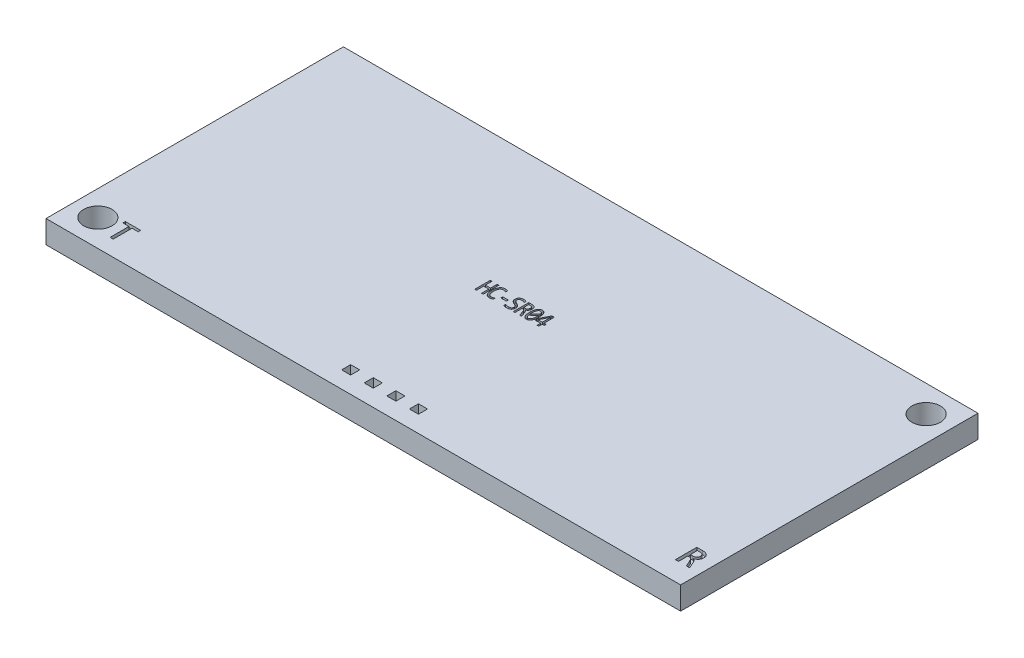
from build123d import *

# Parameters (mm, degrees)
CROQUIS1_W              = 44.6
CROQUIS1_H              = 20.9
CROQUIS1_R              = 1
SALIENTE_EXTRUIR2_DEPTH = 1.6
CROQUIS3_W              = 0.396538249
CROQUIS3_H              = 0.136456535
CORTAR_EXTRUIR1_DEPTH   = 1
CORTAR_EXTRUIR2_DEPTH   = 1
CROQUIS5_W              = 0.636
CROQUIS5_H              = 0.636
CORTAR_EXTRUIR4_DEPTH   = 10


with BuildPart() as part:
    # Croquis1 → Saliente-Extruir2 (new body)
    with BuildSketch(Plane(origin=(0, 0, 0), x_dir=(1, 0, 0), z_dir=(0, 1, 0))):
        with Locations((22.3, -10.45)):
            Rectangle(CROQUIS1_W, CROQUIS1_H)
        with Locations(Location((42.832264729, -1.877461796, 0), (0, 0, 90))):
            Circle(CROQUIS1_R, mode=Mode.SUBTRACT)
        with Locations(Location((1.767735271, -19.022538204, 0), (0, 0, 90))):
            Circle(CROQUIS1_R, mode=Mode.SUBTRACT)
    extrude(amount=SALIENTE_EXTRUIR2_DEPTH)

    # Croquis3 → Cortar-Extruir1 (cut)
    # profile 1 of 7: a face of its own
    with BuildSketch(Plane(origin=(0, 2.345630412, 0), x_dir=(1, 0, 0), z_dir=(0, 1, 0))):
        Polygon((19.973748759, -10.139175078), (19.85555223, -10.139175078), (19.85555223, -9.639492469), (19.491585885, -9.639492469), (19.491585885, -10.139175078), (19.373389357, -10.139175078), (19.373389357, -9.050730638), (19.491585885, -9.050730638), (19.491585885, -9.51117891), (19.85555223, -9.51117891), (19.85555223, -9.050730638), (19.973748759, -9.050730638), align=None)
    # profile 2 of 7: a face of its own
    with BuildSketch(Plane(origin=(0, 2.345630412, 0), x_dir=(1, 0, 0), z_dir=(0, 1, 0))):
        with BuildLine():
            add(Edge.make_bspline(
                [(20.627703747, -10.098460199), (20.610374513, -10.106830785), (20.576036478, -10.123417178), (20.521537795, -10.13980278), (20.466007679, -10.15052594), (20.428456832, -10.151839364), (20.409570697, -10.152499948)],
                knots=[0, 0, 0, 0, 1.016780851, 2.014760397, 3.001527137, 4, 4, 4, 4], degree=3))
            add(Edge.make_bspline(
                [(20.409570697, -10.152499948), (20.39465692, -10.15208389), (20.365590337, -10.151273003), (20.323405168, -10.144666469), (20.283735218, -10.13430462), (20.247044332, -10.118639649), (20.212594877, -10.099464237), (20.181120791, -10.075470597), (20.152214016, -10.047356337), (20.126323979, -10.014735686), (20.103006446, -9.978093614), (20.083106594, -9.937139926), (20.066300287, -9.892082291), (20.052668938, -9.842929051), (20.041790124, -9.789759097), (20.034348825, -9.73244375), (20.029538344, -9.671077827), (20.029067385, -9.628727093), (20.028824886, -9.606920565)],
                knots=[0, 0, 0, 0, 0.94991527, 1.851361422, 2.714727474, 3.555816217, 4.386716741, 5.22119729, 6.070041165, 6.950049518, 7.869063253, 8.832533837, 9.846022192, 10.929629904, 12.079947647, 13.301629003, 14.610600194, 16, 16, 16, 16], degree=3))
            add(Edge.make_bspline(
                [(20.028824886, -9.606920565), (20.02913283, -9.585605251), (20.029734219, -9.543978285), (20.035105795, -9.483180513), (20.043285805, -9.425527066), (20.055130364, -9.371190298), (20.070082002, -9.320362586), (20.088050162, -9.273275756), (20.108975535, -9.230214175), (20.132776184, -9.19121476), (20.159158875, -9.156100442), (20.188594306, -9.125492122), (20.220573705, -9.098916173), (20.25512076, -9.076612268), (20.292290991, -9.059037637), (20.331652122, -9.046310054), (20.373254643, -9.038766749), (20.401725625, -9.037865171), (20.416233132, -9.037405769)],
                knots=[0, 0, 0, 0, 1.327786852, 2.593052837, 3.799758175, 4.953719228, 6.054723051, 7.097814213, 8.090224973, 9.033298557, 9.940388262, 10.821139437, 11.672830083, 12.525753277, 13.376225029, 14.227067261, 15.096594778, 16, 16, 16, 16], degree=3))
            add(Edge.make_bspline(
                [(20.416233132, -9.037405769), (20.42610961, -9.037519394), (20.445565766, -9.037743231), (20.47414272, -9.04035822), (20.501702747, -9.044166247), (20.528193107, -9.049998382), (20.554088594, -9.057023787), (20.579125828, -9.066310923), (20.603893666, -9.076847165), (20.619705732, -9.08539472), (20.627703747, -9.08971822)],
                knots=[0, 0, 0, 0, 1.075434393, 2.11855081, 3.123295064, 4.103821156, 5.071119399, 6.04321857, 7.010226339, 8, 8, 8, 8], degree=3))
            Line((20.627703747, -9.08971822), (20.627703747, -9.235551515))
            add(Edge.make_bspline(
                [(20.627703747, -9.235551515), (20.619883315, -9.230327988), (20.604405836, -9.219990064), (20.580041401, -9.206768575), (20.555508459, -9.195053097), (20.53031524, -9.185621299), (20.504425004, -9.178129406), (20.477451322, -9.172694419), (20.449215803, -9.169416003), (20.429978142, -9.169092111), (20.420181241, -9.168927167)],
                knots=[0, 0, 0, 0, 1.018287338, 2.015300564, 2.999852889, 3.961395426, 4.92586479, 5.916687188, 6.939059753, 8, 8, 8, 8], degree=3))
            add(Edge.make_bspline(
                [(20.420181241, -9.168927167), (20.410201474, -9.169219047), (20.390661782, -9.169790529), (20.362032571, -9.175502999), (20.334895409, -9.184577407), (20.309213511, -9.197255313), (20.285522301, -9.213519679), (20.263242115, -9.2325703), (20.243291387, -9.255352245), (20.224949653, -9.28110542), (20.208755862, -9.310014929), (20.194625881, -9.342034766), (20.182435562, -9.376959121), (20.172036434, -9.414861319), (20.163922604, -9.455589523), (20.158395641, -9.499211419), (20.154893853, -9.545503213), (20.154420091, -9.577303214), (20.154177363, -9.593595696)],
                knots=[0, 0, 0, 0, 0.855273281, 1.674565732, 2.493523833, 3.304569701, 4.122676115, 4.953136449, 5.812823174, 6.713525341, 7.661447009, 8.65019893, 9.712535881, 10.832132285, 12.019525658, 13.272043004, 14.602352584, 16, 16, 16, 16], degree=3))
            add(Edge.make_bspline(
                [(20.154177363, -9.593595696), (20.154338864, -9.610709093), (20.15465208, -9.64389894), (20.15785116, -9.692006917), (20.163284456, -9.736805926), (20.17054721, -9.778381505), (20.180092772, -9.816769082), (20.191973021, -9.851888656), (20.205603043, -9.883931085), (20.221802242, -9.912456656), (20.239713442, -9.937951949), (20.2601867, -9.959684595), (20.282222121, -9.978615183), (20.306664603, -9.993580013), (20.332842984, -10.005720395), (20.361124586, -10.013971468), (20.391376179, -10.019025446), (20.412182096, -10.019663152), (20.422895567, -10.019991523)],
                knots=[0, 0, 0, 0, 1.444903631, 2.802256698, 4.068620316, 5.253899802, 6.363986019, 7.405050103, 8.381782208, 9.299254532, 10.170420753, 11.00583044, 11.814182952, 12.6159143, 13.417765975, 14.244002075, 15.095794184, 16, 16, 16, 16], degree=3))
            add(Edge.make_bspline(
                [(20.422895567, -10.019991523), (20.432031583, -10.01979181), (20.450269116, -10.019393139), (20.477288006, -10.016501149), (20.50369148, -10.011086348), (20.538276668, -10.002004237), (20.580458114, -9.985501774), (20.611868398, -9.967582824), (20.627703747, -9.958549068)],
                knots=[0, 0, 0, 0, 0.759244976, 1.51562283, 2.254279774, 2.997099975, 4.486101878, 6, 6, 6, 6], degree=3))
            Line((20.627703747, -9.958549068), (20.627703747, -10.098460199))
        make_face()
    # profile 3 of 7: a face of its own
    with BuildSketch(Plane(origin=(0, 2.345630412, 0), x_dir=(1, 0, 0), z_dir=(0, 1, 0))):
        with Locations((21.009362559, -9.685265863)):
            Rectangle(CROQUIS3_W, CROQUIS3_H)
    # profile 4 of 7: a face of its own
    with BuildSketch(Plane(origin=(0, 2.345630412, 0), x_dir=(1, 0, 0), z_dir=(0, 1, 0))):
        with BuildLine():
            add(Edge.make_bspline(
                [(21.964977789, -9.844300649), (21.964727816, -9.85681859), (21.96424079, -9.881207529), (21.959475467, -9.916593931), (21.951690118, -9.949643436), (21.940485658, -9.980122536), (21.926628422, -10.008147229), (21.910227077, -10.03385786), (21.891237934, -10.057027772), (21.86980133, -10.077746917), (21.845977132, -10.095803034), (21.819840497, -10.111359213), (21.791558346, -10.124821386), (21.760917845, -10.135544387), (21.728378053, -10.143898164), (21.694118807, -10.14970956), (21.658346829, -10.153566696), (21.633922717, -10.154004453), (21.621492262, -10.154227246)],
                knots=[0, 0, 0, 0, 1.143946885, 2.228773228, 3.257490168, 4.242423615, 5.190822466, 6.110768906, 7.024547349, 7.923349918, 8.830295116, 9.751132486, 10.699740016, 11.689199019, 12.71425371, 13.767606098, 14.863841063, 16, 16, 16, 16], degree=3))
            add(Edge.make_bspline(
                [(21.621492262, -10.154227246), (21.610055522, -10.154097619), (21.587155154, -10.153838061), (21.553137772, -10.151354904), (21.51988916, -10.147092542), (21.487695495, -10.143069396), (21.457170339, -10.137105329), (21.42845327, -10.131213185), (21.402077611, -10.124247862), (21.385413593, -10.119154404), (21.377449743, -10.116720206)],
                knots=[0, 0, 0, 0, 1.10764159, 2.217887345, 3.300931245, 4.354386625, 5.359118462, 6.312274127, 7.193424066, 8, 8, 8, 8], degree=3))
            Line((21.377449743, -10.116720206), (21.377449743, -9.973354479))
            add(Edge.make_bspline(
                [(21.377449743, -9.973354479), (21.385961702, -9.977156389), (21.403265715, -9.984885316), (21.430523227, -9.994795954), (21.459391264, -10.002941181), (21.489683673, -10.010552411), (21.521796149, -10.016564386), (21.556043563, -10.020185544), (21.592321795, -10.02322144), (21.617290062, -10.023369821), (21.630128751, -10.023446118)],
                knots=[0, 0, 0, 0, 0.861406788, 1.751159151, 2.677346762, 3.632377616, 4.637293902, 5.693351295, 6.813920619, 8, 8, 8, 8], degree=3))
            add(Edge.make_bspline(
                [(21.630128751, -10.023446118), (21.639261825, -10.023289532), (21.656892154, -10.022987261), (21.682289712, -10.02109601), (21.705638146, -10.017673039), (21.726958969, -10.012802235), (21.746278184, -10.006385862), (21.763699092, -9.998680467), (21.779422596, -9.989906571), (21.793076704, -9.979383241), (21.805126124, -9.967647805), (21.815358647, -9.954682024), (21.824035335, -9.940569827), (21.830565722, -9.925125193), (21.835833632, -9.90862139), (21.839111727, -9.890871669), (21.841466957, -9.872164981), (21.841717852, -9.859278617), (21.841846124, -9.852690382)],
                knots=[0, 0, 0, 0, 1.404098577, 2.710447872, 3.912180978, 5.028663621, 6.068319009, 7.03637822, 7.953897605, 8.828958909, 9.678430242, 10.53352976, 11.361940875, 12.217040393, 13.104890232, 14.019966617, 14.987695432, 16, 16, 16, 16], degree=3))
            add(Edge.make_bspline(
                [(21.841846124, -9.852690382), (21.841624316, -9.845598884), (21.841192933, -9.831807), (21.837422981, -9.811958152), (21.831334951, -9.793672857), (21.819361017, -9.771776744), (21.800170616, -9.746491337), (21.770571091, -9.720535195), (21.736358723, -9.69677455), (21.697538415, -9.676013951), (21.656507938, -9.655668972), (21.614502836, -9.634688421), (21.572714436, -9.61201678), (21.53145192, -9.588119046), (21.492591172, -9.560767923), (21.46390191, -9.533688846), (21.443770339, -9.509515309), (21.429768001, -9.490057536), (21.417880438, -9.468725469), (21.407014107, -9.446130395), (21.39820133, -9.421568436), (21.392572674, -9.394746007), (21.388662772, -9.365871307), (21.388266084, -9.345866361), (21.388060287, -9.335488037)],
                knots=[0, 0, 0, 0, 0.637470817, 1.239783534, 1.810780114, 2.363601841, 3.478050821, 4.646330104, 5.890315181, 7.218560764, 8.601877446, 10.011680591, 11.4420749, 12.878695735, 14.299795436, 15.707830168, 16.411798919, 17.128372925, 17.860818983, 18.605608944, 19.38263948, 20.201330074, 21.066871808, 22, 22, 22, 22], degree=3))
            add(Edge.make_bspline(
                [(21.388060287, -9.335488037), (21.38830875, -9.326182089), (21.38880297, -9.307671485), (21.39245218, -9.280038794), (21.398032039, -9.252600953), (21.406208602, -9.225518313), (21.416636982, -9.199098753), (21.430078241, -9.174230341), (21.445710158, -9.150723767), (21.464065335, -9.128940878), (21.48512542, -9.108870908), (21.509029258, -9.090726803), (21.535716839, -9.074785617), (21.565073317, -9.060841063), (21.597322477, -9.049363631), (21.632677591, -9.041346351), (21.670967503, -9.036715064), (21.697398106, -9.036031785), (21.711064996, -9.035678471)],
                knots=[0, 0, 0, 0, 0.899564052, 1.789336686, 2.690867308, 3.604212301, 4.521323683, 5.432172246, 6.332122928, 7.246540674, 8.180328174, 9.139476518, 10.141959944, 11.180727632, 12.277429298, 13.444592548, 14.678635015, 16, 16, 16, 16], degree=3))
            add(Edge.make_bspline(
                [(21.711064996, -9.035678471), (21.718719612, -9.035736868), (21.734547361, -9.035857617), (21.758969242, -9.038153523), (21.78444788, -9.040820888), (21.810287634, -9.04531917), (21.836200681, -9.049754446), (21.861577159, -9.055525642), (21.886030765, -9.061549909), (21.901820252, -9.066065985), (21.909457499, -9.068250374)],
                knots=[0, 0, 0, 0, 0.910573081, 1.882827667, 2.917346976, 3.958559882, 5.003080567, 6.045718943, 7.054729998, 8, 8, 8, 8], degree=3))
            Line((21.909457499, -9.068250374), (21.909457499, -9.20149907))
            add(Edge.make_bspline(
                [(21.909457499, -9.20149907), (21.892523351, -9.195747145), (21.85904464, -9.184375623), (21.807908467, -9.173158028), (21.757764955, -9.165535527), (21.724580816, -9.164498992), (21.708350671, -9.16399203)],
                knots=[0, 0, 0, 0, 1.043499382, 2.062992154, 3.052622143, 4, 4, 4, 4], degree=3))
            add(Edge.make_bspline(
                [(21.708350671, -9.16399203), (21.70020303, -9.164142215), (21.684376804, -9.16443394), (21.661472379, -9.166444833), (21.640150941, -9.169495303), (21.620620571, -9.174253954), (21.602683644, -9.180042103), (21.586546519, -9.187577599), (21.571906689, -9.196136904), (21.554928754, -9.209169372), (21.53750319, -9.22866729), (21.522029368, -9.255849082), (21.512961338, -9.287056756), (21.51195923, -9.309025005), (21.511438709, -9.320435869)],
                knots=[0, 0, 0, 0, 1.026072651, 1.993074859, 2.894123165, 3.73586976, 4.522109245, 5.263744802, 5.974417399, 6.654058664, 7.952321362, 9.237289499, 10.564978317, 12, 12, 12, 12], degree=3))
            add(Edge.make_bspline(
                [(21.511438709, -9.320435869), (21.511651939, -9.327529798), (21.51206664, -9.341326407), (21.515964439, -9.361193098), (21.521703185, -9.379783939), (21.533539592, -9.402147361), (21.553242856, -9.427491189), (21.582499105, -9.454146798), (21.616990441, -9.477676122), (21.655442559, -9.499001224), (21.696634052, -9.519070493), (21.73836921, -9.540559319), (21.780552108, -9.562684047), (21.821594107, -9.587375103), (21.860764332, -9.614997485), (21.889479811, -9.642769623), (21.909418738, -9.667554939), (21.923642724, -9.687235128), (21.935100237, -9.709178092), (21.945989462, -9.732113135), (21.954877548, -9.757064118), (21.960455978, -9.784308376), (21.964365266, -9.813590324), (21.964769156, -9.833840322), (21.964977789, -9.844300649)],
                knots=[0, 0, 0, 0, 0.632967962, 1.231026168, 1.802636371, 2.364578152, 3.481450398, 4.651394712, 5.886592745, 7.202628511, 8.576173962, 9.979350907, 11.396159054, 12.830181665, 14.255802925, 15.669158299, 16.379493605, 17.097012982, 17.833542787, 18.586384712, 19.364857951, 20.192117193, 21.066121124, 22, 22, 22, 22], degree=3))
        make_face()
    # profile 5 of 7: a face of its own
    with BuildSketch(Plane(origin=(0, 2.345630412, 0), x_dir=(1, 0, 0), z_dir=(0, 1, 0))):
        with BuildLine():
            Line((22.669024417, -10.139175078), (22.535528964, -10.139175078))
            Line((22.535528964, -10.139175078), (22.406228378, -9.791001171))
            add(Edge.make_bspline(
                [(22.406228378, -9.791001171), (22.401504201, -9.778737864), (22.392797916, -9.756137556), (22.377717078, -9.726014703), (22.361908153, -9.701863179), (22.344565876, -9.683391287), (22.325883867, -9.669408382), (22.30513571, -9.66049308), (22.282434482, -9.655472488), (22.266673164, -9.654863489), (22.258421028, -9.654544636)],
                knots=[0, 0, 0, 0, 1.448627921, 2.669706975, 3.708756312, 4.619923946, 5.450894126, 6.263237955, 7.090685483, 8, 8, 8, 8], degree=3))
            Line((22.258421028, -9.654544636), (22.202653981, -9.654544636))
            Line((22.202653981, -9.654544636), (22.202653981, -10.139175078))
            Line((22.202653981, -10.139175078), (22.08470421, -10.139175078))
            Line((22.08470421, -10.139175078), (22.08470421, -9.050730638))
            Line((22.08470421, -9.050730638), (22.3169024, -9.050730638))
            add(Edge.make_bspline(
                [(22.3169024, -9.050730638), (22.329087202, -9.050931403), (22.352621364, -9.051319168), (22.38657242, -9.055298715), (22.41782034, -9.061879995), (22.446438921, -9.071146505), (22.472697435, -9.082311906), (22.496293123, -9.096142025), (22.517779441, -9.111522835), (22.536246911, -9.129616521), (22.552882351, -9.149149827), (22.566557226, -9.171072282), (22.578357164, -9.194740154), (22.587579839, -9.220372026), (22.594643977, -9.247574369), (22.599927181, -9.276174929), (22.602819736, -9.306227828), (22.60319573, -9.326763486), (22.603387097, -9.337215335)],
                knots=[0, 0, 0, 0, 1.263078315, 2.439554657, 3.538662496, 4.569067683, 5.554652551, 6.490951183, 7.400247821, 8.287023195, 9.165059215, 10.054742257, 10.958783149, 11.903205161, 12.873502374, 13.870608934, 14.9162231, 16, 16, 16, 16], degree=3))
            add(Edge.make_bspline(
                [(22.603387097, -9.337215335), (22.602873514, -9.353712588), (22.601863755, -9.386147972), (22.593813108, -9.425647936), (22.585025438, -9.45554844), (22.576728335, -9.476701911), (22.56723147, -9.496907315), (22.556059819, -9.515910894), (22.543628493, -9.533826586), (22.529920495, -9.550655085), (22.514367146, -9.565983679), (22.497785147, -9.58030413), (22.479670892, -9.592944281), (22.460208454, -9.603815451), (22.439583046, -9.613361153), (22.424958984, -9.617936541), (22.417579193, -9.620245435)],
                knots=[0, 0, 0, 0, 1.899675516, 3.734967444, 4.625859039, 5.490377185, 6.351300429, 7.196894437, 8.028012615, 8.863230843, 9.694565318, 10.541964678, 11.386281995, 12.235377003, 13.109512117, 14, 14, 14, 14], degree=3))
            add(Edge.make_bspline(
                [(22.417579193, -9.620245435), (22.423527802, -9.623186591), (22.43559281, -9.629151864), (22.452028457, -9.641783), (22.466809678, -9.657491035), (22.480269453, -9.676240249), (22.492977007, -9.697997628), (22.506072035, -9.722653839), (22.519181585, -9.75064803), (22.527315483, -9.770644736), (22.531580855, -9.781130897)],
                knots=[0, 0, 0, 0, 0.786710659, 1.5956118, 2.445534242, 3.340471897, 4.330639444, 5.436289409, 6.655604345, 8, 8, 8, 8], degree=3))
            Line((22.531580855, -9.781130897), (22.669024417, -10.139175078))
        make_face()
        with BuildLine():
            add(Edge.make_bspline(
                [(22.480008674, -9.349553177), (22.479850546, -9.342475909), (22.479544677, -9.328786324), (22.477655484, -9.308960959), (22.474119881, -9.290584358), (22.469527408, -9.273431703), (22.463400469, -9.257712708), (22.455920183, -9.243353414), (22.446950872, -9.230508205), (22.433507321, -9.214956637), (22.412985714, -9.198849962), (22.383894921, -9.185160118), (22.350412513, -9.176929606), (22.326657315, -9.17605086), (22.314188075, -9.175589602)],
                knots=[0, 0, 0, 0, 0.928768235, 1.796519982, 2.609374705, 3.381814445, 4.123400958, 4.818611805, 5.501225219, 6.174387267, 7.51107262, 8.88692394, 10.365928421, 12, 12, 12, 12], degree=3))
            Line((22.314188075, -9.175589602), (22.202653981, -9.175589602))
            Line((22.202653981, -9.175589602), (22.202653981, -9.53536108))
            Line((22.202653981, -9.53536108), (22.29814888, -9.53536108))
            add(Edge.make_bspline(
                [(22.29814888, -9.53536108), (22.304980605, -9.535220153), (22.318270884, -9.534945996), (22.33770899, -9.532778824), (22.355976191, -9.528694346), (22.373301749, -9.523645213), (22.389559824, -9.516937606), (22.404488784, -9.508569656), (22.418266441, -9.498861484), (22.430694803, -9.48767956), (22.441753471, -9.475014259), (22.451799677, -9.461162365), (22.460063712, -9.445716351), (22.467362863, -9.429108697), (22.472935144, -9.411045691), (22.477168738, -9.391747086), (22.479671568, -9.371087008), (22.479893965, -9.356880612), (22.480008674, -9.349553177)],
                knots=[0, 0, 0, 0, 1.112165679, 2.163581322, 3.177401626, 4.156033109, 5.098542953, 6.033699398, 6.936563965, 7.837340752, 8.748114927, 9.669653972, 10.616529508, 11.594152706, 12.619055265, 13.688060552, 14.807538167, 16, 16, 16, 16], degree=3))
        make_face(mode=Mode.SUBTRACT)
    # profile 6 of 7: a face of its own
    with BuildSketch(Plane(origin=(0, 2.345630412, 0), x_dir=(1, 0, 0), z_dir=(0, 1, 0))):
        with BuildLine():
            add(Edge.make_bspline(
                [(23.328408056, -9.595322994), (23.328170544, -9.61564396), (23.327704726, -9.655498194), (23.324078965, -9.713904), (23.317526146, -9.769535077), (23.30916387, -9.822327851), (23.297851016, -9.871868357), (23.284040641, -9.917967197), (23.267904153, -9.960581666), (23.248905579, -9.999407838), (23.227567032, -10.034322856), (23.203574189, -10.065126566), (23.177251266, -10.091956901), (23.148098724, -10.114348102), (23.116618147, -10.132472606), (23.082236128, -10.145038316), (23.04533071, -10.152988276), (23.019757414, -10.153807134), (23.006637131, -10.154227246)],
                knots=[0, 0, 0, 0, 1.357675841, 2.662724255, 3.907448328, 5.099118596, 6.232279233, 7.299772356, 8.31220489, 9.273185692, 10.183688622, 11.041150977, 11.876635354, 12.687836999, 13.490129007, 14.293493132, 15.124483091, 16, 16, 16, 16], degree=3))
            add(Edge.make_bspline(
                [(23.006637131, -10.154227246), (22.995257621, -10.15388195), (22.972899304, -10.153203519), (22.940179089, -10.146815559), (22.909130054, -10.136324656), (22.879473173, -10.122059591), (22.851841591, -10.103020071), (22.826359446, -10.079550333), (22.802748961, -10.051943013), (22.781468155, -10.019760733), (22.762514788, -9.982983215), (22.745822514, -9.941563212), (22.731321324, -9.895532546), (22.719272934, -9.844823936), (22.71007122, -9.789240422), (22.703163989, -9.728965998), (22.699349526, -9.663723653), (22.69874925, -9.618687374), (22.698437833, -9.595322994)],
                knots=[0, 0, 0, 0, 0.766528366, 1.506065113, 2.23730171, 2.971392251, 3.717366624, 4.49062492, 5.300799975, 6.160527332, 7.085652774, 8.085535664, 9.167597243, 10.3363946, 11.596275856, 12.963704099, 14.42479945, 16, 16, 16, 16], degree=3))
            add(Edge.make_bspline(
                [(22.698437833, -9.595322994), (22.698670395, -9.574919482), (22.699124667, -9.5350645), (22.702798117, -9.476580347), (22.709295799, -9.420944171), (22.717702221, -9.367991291), (22.72903187, -9.318301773), (22.742661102, -9.271933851), (22.759323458, -9.22945649), (22.777851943, -9.190410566), (22.799397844, -9.155589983), (22.823094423, -9.124540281), (22.849700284, -9.097973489), (22.878769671, -9.075464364), (22.91043411, -9.057503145), (22.9448491, -9.044854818), (22.981602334, -9.036955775), (23.007007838, -9.03610982), (23.019962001, -9.035678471)],
                knots=[0, 0, 0, 0, 1.362325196, 2.661083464, 3.910491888, 5.101423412, 6.239235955, 7.311327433, 8.325112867, 9.283092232, 10.19303072, 11.054297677, 11.885371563, 12.696070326, 13.50264726, 14.305513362, 15.135988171, 16, 16, 16, 16], degree=3))
            add(Edge.make_bspline(
                [(23.019962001, -9.035678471), (23.031342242, -9.036022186), (23.053701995, -9.036697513), (23.086411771, -9.043108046), (23.11753429, -9.053526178), (23.147074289, -9.068131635), (23.174662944, -9.087140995), (23.200485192, -9.110372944), (23.223751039, -9.138476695), (23.245078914, -9.170829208), (23.26415132, -9.207718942), (23.280711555, -9.249272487), (23.295307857, -9.295352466), (23.307247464, -9.346097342), (23.316848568, -9.401541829), (23.32367038, -9.46176522), (23.327500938, -9.526921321), (23.328098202, -9.571958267), (23.328408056, -9.595322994)],
                knots=[0, 0, 0, 0, 0.765936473, 1.504902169, 2.235574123, 2.971542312, 3.716940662, 4.485877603, 5.303878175, 6.1675575, 7.091968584, 8.096213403, 9.177439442, 10.345334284, 11.60518128, 12.966048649, 14.42601578, 16, 16, 16, 16], degree=3))
        make_face()
        with BuildLine():
            add(Edge.make_bspline(
                [(23.211692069, -9.60025813), (23.211584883, -9.590879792), (23.211371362, -9.572197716), (23.210028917, -9.544231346), (23.208321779, -9.516678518), (23.206941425, -9.498428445), (23.206263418, -9.489464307)],
                knots=[0, 0, 0, 0, 1.014305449, 2.020542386, 3.027722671, 4, 4, 4, 4], degree=3))
            Line((23.206263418, -9.489464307), (22.839582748, -9.831962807))
            add(Edge.make_bspline(
                [(22.839582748, -9.831962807), (22.843160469, -9.845840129), (22.850142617, -9.872922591), (22.863701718, -9.911283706), (22.880272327, -9.945575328), (22.900202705, -9.974919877), (22.923688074, -9.998448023), (22.945729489, -10.013663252), (22.964874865, -10.022376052), (22.980284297, -10.026693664), (22.996498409, -10.029534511), (23.007611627, -10.029914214), (23.013299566, -10.030108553)],
                knots=[0, 0, 0, 0, 1.502976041, 2.933151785, 4.260622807, 5.488505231, 6.635567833, 7.729267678, 8.27771504, 8.834782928, 9.403621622, 10, 10, 10, 10], degree=3))
            add(Edge.make_bspline(
                [(23.013299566, -10.030108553), (23.020651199, -10.029781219), (23.035292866, -10.029129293), (23.056540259, -10.023757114), (23.076832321, -10.015208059), (23.095864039, -10.002957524), (23.113686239, -9.987279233), (23.130007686, -9.968226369), (23.145157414, -9.946108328), (23.158697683, -9.920492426), (23.170547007, -9.891550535), (23.181600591, -9.859585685), (23.190498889, -9.82420982), (23.19811907, -9.785661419), (23.204279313, -9.743835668), (23.208687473, -9.698795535), (23.211031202, -9.650539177), (23.211467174, -9.617368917), (23.211692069, -9.60025813)],
                knots=[0, 0, 0, 0, 0.678603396, 1.351520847, 2.012264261, 2.706024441, 3.433249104, 4.198377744, 5.018541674, 5.906103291, 6.870298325, 7.906333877, 9.02911302, 10.238099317, 11.536695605, 12.934443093, 14.418640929, 16, 16, 16, 16], degree=3))
        make_face(mode=Mode.SUBTRACT)
        with BuildLine():
            add(Edge.make_bspline(
                [(22.81515382, -9.590387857), (22.815139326, -9.598942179), (22.815110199, -9.616133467), (22.8153289, -9.641798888), (22.8159538, -9.667149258), (22.817070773, -9.683829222), (22.817621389, -9.692051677)],
                knots=[0, 0, 0, 0, 1.00914959, 2.028048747, 3.02791882, 4, 4, 4, 4], degree=3))
            Line((22.817621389, -9.692051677), (23.184302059, -9.351280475))
            add(Edge.make_bspline(
                [(23.184302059, -9.351280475), (23.180885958, -9.337702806), (23.1742653, -9.311388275), (23.160013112, -9.274696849), (23.14380923, -9.241685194), (23.123984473, -9.213560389), (23.101237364, -9.190255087), (23.079114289, -9.175913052), (23.060218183, -9.167708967), (23.045417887, -9.162786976), (23.029573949, -9.16048272), (23.018815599, -9.160029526), (23.013299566, -9.159797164)],
                knots=[0, 0, 0, 0, 1.508489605, 2.923564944, 4.236631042, 5.464735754, 6.618822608, 7.728454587, 8.280551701, 8.838813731, 9.40463532, 10, 10, 10, 10], degree=3))
            add(Edge.make_bspline(
                [(23.013299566, -9.159797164), (23.005947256, -9.160119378), (22.991384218, -9.160757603), (22.970116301, -9.166187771), (22.949869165, -9.174920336), (22.930813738, -9.187198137), (22.912837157, -9.202619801), (22.896532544, -9.221726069), (22.881443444, -9.244054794), (22.867963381, -9.269855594), (22.855995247, -9.298909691), (22.845003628, -9.331066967), (22.836150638, -9.366610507), (22.82839477, -9.40520692), (22.822681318, -9.447002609), (22.818115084, -9.491927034), (22.815825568, -9.540108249), (22.815382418, -9.57327756), (22.81515382, -9.590387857)],
                knots=[0, 0, 0, 0, 0.677903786, 1.342753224, 2.012786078, 2.705831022, 3.427328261, 4.191668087, 5.017261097, 5.910613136, 6.873814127, 7.915971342, 9.044945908, 10.252685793, 11.548853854, 12.937603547, 14.420271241, 16, 16, 16, 16], degree=3))
        make_face(mode=Mode.SUBTRACT)
    # profile 7 of 7: a face of its own
    with BuildSketch(Plane(origin=(0, 2.345630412, 0), x_dir=(1, 0, 0), z_dir=(0, 1, 0))):
        Polygon((24.019623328, -9.898587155), (23.871569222, -9.898587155), (23.871569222, -10.139175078), (23.75361945, -10.139175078), (23.75361945, -9.898587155), (23.336600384, -9.898587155), (23.336600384, -9.771013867), (23.705995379, -9.050730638), (23.871569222, -9.050730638), (23.871569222, -9.771013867), (24.019623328, -9.771013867), align=None)
        Polygon((23.75361945, -9.190641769), (23.45183583, -9.771013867), (23.75361945, -9.771013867), align=None, mode=Mode.SUBTRACT)
    extrude(amount=-CORTAR_EXTRUIR1_DEPTH, mode=Mode.SUBTRACT)

    # Croquis4 → Cortar-Extruir2 (cut)
    # profile 1 of 2: a face of its own
    with BuildSketch(Plane(origin=(0, 2.345630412, 0), x_dir=(1, 0, 0), z_dir=(0, 1, 0))):
        with BuildLine():
            Line((43.879153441, -19.541178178), (43.648854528, -19.541178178))
            Line((43.648854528, -19.541178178), (43.433161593, -19.072767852))
            add(Edge.make_bspline(
                [(43.433161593, -19.072767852), (43.425367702, -19.05616099), (43.410909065, -19.025353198), (43.385451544, -18.984899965), (43.359084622, -18.952306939), (43.33052326, -18.927249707), (43.29936373, -18.908969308), (43.265408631, -18.897142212), (43.228165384, -18.890267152), (43.202214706, -18.889438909), (43.188596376, -18.889004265)],
                knots=[0, 0, 0, 0, 1.339134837, 2.484261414, 3.482991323, 4.391871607, 5.244507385, 6.105289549, 7.005698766, 8, 8, 8, 8], degree=3))
            Line((43.188596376, -18.889004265), (43.096544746, -18.889004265))
            Line((43.096544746, -18.889004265), (43.096544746, -19.541178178))
            Line((43.096544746, -19.541178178), (42.879153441, -19.541178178))
            Line((42.879153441, -19.541178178), (42.879153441, -18.041178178))
            Line((42.879153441, -18.041178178), (43.277930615, -18.041178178))
            add(Edge.make_bspline(
                [(43.277930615, -18.041178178), (43.298890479, -18.041449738), (43.339301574, -18.041973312), (43.397651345, -18.047492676), (43.451438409, -18.056396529), (43.500579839, -18.069423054), (43.545408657, -18.085340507), (43.586078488, -18.104362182), (43.622594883, -18.126377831), (43.654818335, -18.151497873), (43.683304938, -18.178911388), (43.707210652, -18.209617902), (43.727482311, -18.242691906), (43.743391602, -18.278637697), (43.755454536, -18.316745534), (43.764458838, -18.356834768), (43.769485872, -18.39895171), (43.770130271, -18.427714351), (43.770457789, -18.44233307)],
                knots=[0, 0, 0, 0, 1.390037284, 2.680023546, 3.883960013, 5.002565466, 6.047913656, 7.03574216, 7.976084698, 8.870016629, 9.741095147, 10.591561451, 11.444313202, 12.308368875, 13.191986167, 14.092206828, 15.030357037, 16, 16, 16, 16], degree=3))
            add(Edge.make_bspline(
                [(43.770457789, -18.44233307), (43.770186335, -18.454119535), (43.769652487, -18.477299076), (43.765728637, -18.511570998), (43.759787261, -18.54490092), (43.750884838, -18.577134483), (43.739658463, -18.608146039), (43.72610027, -18.637911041), (43.709647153, -18.666100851), (43.691023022, -18.693009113), (43.66983205, -18.718201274), (43.646428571, -18.741762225), (43.620252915, -18.76313877), (43.592316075, -18.783223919), (43.561853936, -18.800995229), (43.529174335, -18.81617976), (43.494443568, -18.82924214), (43.470247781, -18.83576101), (43.457957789, -18.8390722)],
                knots=[0, 0, 0, 0, 1.032708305, 2.030948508, 3.019625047, 3.996933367, 4.957424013, 5.907556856, 6.85893238, 7.814077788, 8.77200233, 9.740252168, 10.719774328, 11.730219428, 12.753012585, 13.805036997, 14.885091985, 16, 16, 16, 16], degree=3))
            add(Edge.make_bspline(
                [(43.457957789, -18.8390722), (43.467947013, -18.842736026), (43.4877663, -18.850005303), (43.515016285, -18.866193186), (43.540645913, -18.885009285), (43.563059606, -18.909056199), (43.584974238, -18.936141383), (43.606696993, -18.967350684), (43.628756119, -19.002570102), (43.642647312, -19.027966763), (43.64987355, -19.041178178)],
                knots=[0, 0, 0, 0, 0.890820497, 1.767447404, 2.649001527, 3.549193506, 4.515009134, 5.571837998, 6.736863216, 8, 8, 8, 8], degree=3))
            Line((43.64987355, -19.041178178), (43.879153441, -19.541178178))
        make_face()
        with BuildLine():
            add(Edge.make_bspline(
                [(43.553066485, -18.456939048), (43.552907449, -18.447078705), (43.55259931, -18.42797384), (43.549188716, -18.400318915), (43.543352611, -18.374642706), (43.535578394, -18.350849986), (43.525865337, -18.328716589), (43.512983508, -18.309005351), (43.498443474, -18.290869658), (43.481648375, -18.274784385), (43.462733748, -18.260791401), (43.441951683, -18.248629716), (43.41949485, -18.23802733), (43.395143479, -18.229470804), (43.36892897, -18.223215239), (43.340924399, -18.218338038), (43.311040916, -18.215745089), (43.290502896, -18.215312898), (43.279968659, -18.215091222)],
                knots=[0, 0, 0, 0, 1.136086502, 2.201219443, 3.204852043, 4.166451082, 5.083443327, 5.98129036, 6.87199526, 7.758098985, 8.653381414, 9.577773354, 10.529401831, 11.511765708, 12.546811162, 13.632454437, 14.78565276, 16, 16, 16, 16], degree=3))
            Line((43.279968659, -18.215091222), (43.096544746, -18.215091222))
            Line((43.096544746, -18.215091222), (43.096544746, -18.715091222))
            Line((43.096544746, -18.715091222), (43.253813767, -18.715091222))
            add(Edge.make_bspline(
                [(43.253813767, -18.715091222), (43.265027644, -18.714890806), (43.286932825, -18.714499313), (43.318887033, -18.71159575), (43.348990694, -18.705867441), (43.377542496, -18.69909321), (43.404127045, -18.689485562), (43.428608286, -18.677862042), (43.451398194, -18.664701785), (43.471679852, -18.648900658), (43.490275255, -18.631525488), (43.506550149, -18.612127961), (43.520708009, -18.590882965), (43.532138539, -18.56750072), (43.541899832, -18.542504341), (43.548043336, -18.515362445), (43.552372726, -18.486742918), (43.552831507, -18.467033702), (43.553066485, -18.456939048)],
                knots=[0, 0, 0, 0, 1.202615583, 2.349188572, 3.435207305, 4.486530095, 5.492783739, 6.45958443, 7.390413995, 8.308405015, 9.210274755, 10.115082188, 11.017605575, 11.940721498, 12.901403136, 13.887978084, 14.918265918, 16, 16, 16, 16], degree=3))
        make_face(mode=Mode.SUBTRACT)
    # profile 2 of 2: a face of its own
    with BuildSketch(Plane(origin=(0, 2.345630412, 0), x_dir=(1, 0, 0), z_dir=(0, 1, 0))):
        Polygon((4.051997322, -18.468631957), (3.617214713, -18.468631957), (3.617214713, -19.794718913), (3.399823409, -19.794718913), (3.399823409, -18.468631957), (2.9650408, -18.468631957), (2.9650408, -18.294718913), (4.051997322, -18.294718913), align=None)
    extrude(amount=-CORTAR_EXTRUIR2_DEPTH, mode=Mode.SUBTRACT)

    # Croquis5 → Cortar-Extruir4 (cut)
    with BuildSketch(Plane(origin=(0, 1.6, 0), x_dir=(1, 0, 0), z_dir=(0, 1, 0))):
        with Locations((21.50575, -19.405831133)):
            Rectangle(CROQUIS5_W, CROQUIS5_H)
        with Locations((23.09425, -19.405831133)):
            Rectangle(CROQUIS5_W, CROQUIS5_H)
        with Locations((24.68275, -19.405831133)):
            Rectangle(CROQUIS5_W, CROQUIS5_H)
        with Locations((19.91725, -19.405831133)):
            Rectangle(CROQUIS5_W, CROQUIS5_H)
    extrude(amount=-CORTAR_EXTRUIR4_DEPTH, mode=Mode.SUBTRACT)


solid = part.part
